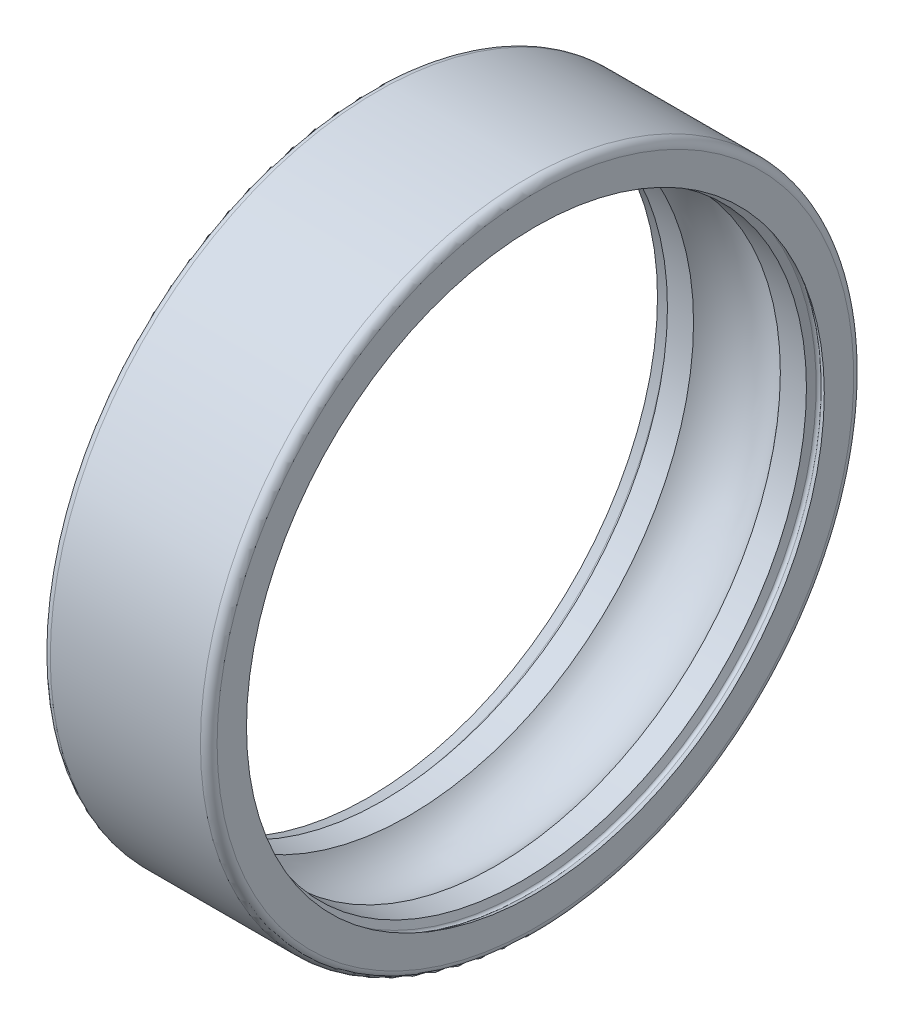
from build123d import *


with BuildPart() as part:
    # Esquisse1 → Base-R_volution (revolve)
    with BuildSketch(Plane.XY, mode=Mode.PRIVATE) as base_r_volution_sk:
        with BuildLine():
            Line((0, 20.784529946), (0, 22.9))
            ThreePointArc((0, 22.9), (0.175735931, 23.324264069), (0.6, 23.5))
            Line((0.6, 23.5), (11.4, 23.5))
            ThreePointArc((11.4, 23.5), (11.824264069, 23.324264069), (12, 22.9))
            Line((12, 22.9), (12, 20.784529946))
            Line((12, 20.784529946), (11.5, 21.073205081))
            ThreePointArc((11.5, 21.073205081), (11.338686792, 21.090369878), (11.217712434, 20.982287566))
            Line((11.217712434, 20.982287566), (11, 20.5))
            Line((11, 20.5), (9.122498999, 20.5))
            ThreePointArc((9.122498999, 20.5), (6, 22), (2.877501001, 20.5))
            Line((2.877501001, 20.5), (1, 20.5))
            Line((1, 20.5), (0.782287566, 20.982287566))
            ThreePointArc((0.782287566, 20.982287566), (0.661313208, 21.090369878), (0.5, 21.073205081))
            Line((0.5, 21.073205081), (0, 20.784529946))
        make_face()
    revolve(base_r_volution_sk.sketch.rotate(Axis((-13, 0, 0), (1, 0, 0)), 90), axis=Axis((-13, 0, 0), (1, 0, 0)))


solid = part.part
